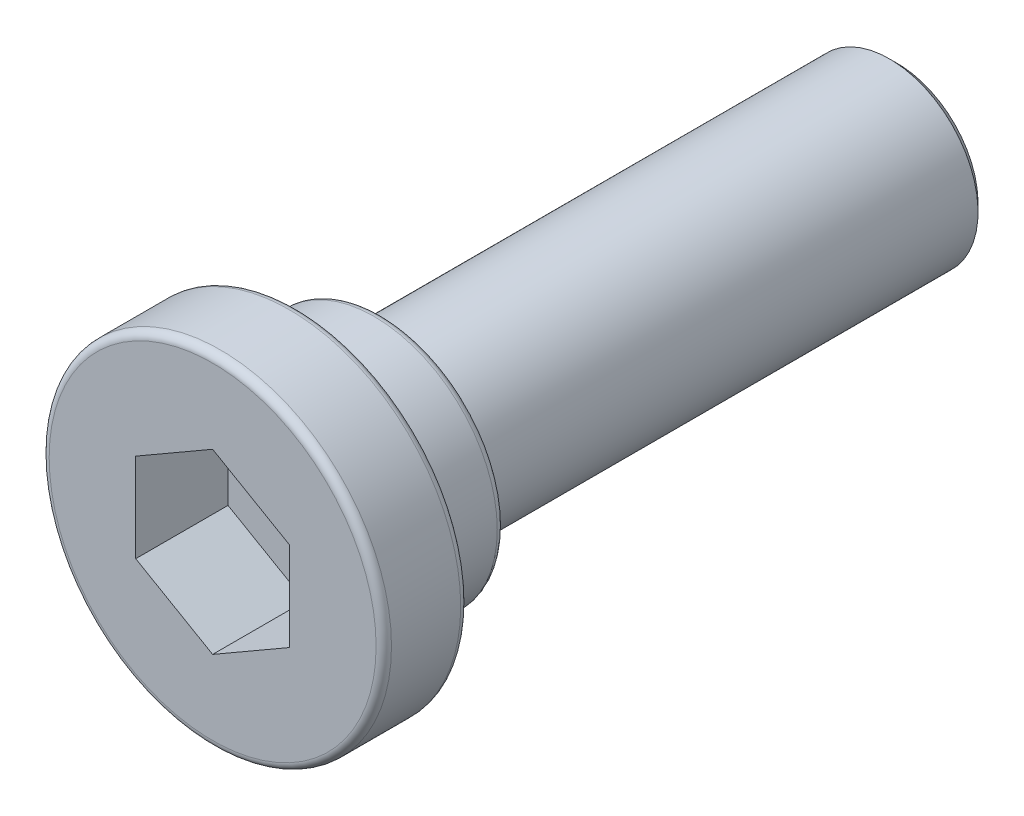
ISO-10303-21;
HEADER;
FILE_DESCRIPTION(('STEP AP214'),'2;1');
FILE_NAME('part.step','',(''),(''),'','','');
FILE_SCHEMA(('AUTOMOTIVE_DESIGN { 1 0 10303 214 1 1 1 1 }'));
ENDSEC;
DATA;
#1=APPLICATION_CONTEXT('core data for automotive mechanical design processes');
#2=APPLICATION_PROTOCOL_DEFINITION('international standard','automotive_design',2000,#1);
#3=PRODUCT_CONTEXT('',#1,'mechanical');
#4=PRODUCT('Part','Part','',(#3));
#5=PRODUCT_RELATED_PRODUCT_CATEGORY('part','',(#4));
#6=PRODUCT_DEFINITION_FORMATION('','',#4);
#7=PRODUCT_DEFINITION_CONTEXT('part definition',#1,'design');
#8=PRODUCT_DEFINITION('design','',#6,#7);
#9=PRODUCT_DEFINITION_SHAPE('','',#8);
#10=(LENGTH_UNIT() NAMED_UNIT(*) SI_UNIT(.MILLI.,.METRE.));
#11=(NAMED_UNIT(*) PLANE_ANGLE_UNIT() SI_UNIT($,.RADIAN.));
#12=(NAMED_UNIT(*) SI_UNIT($,.STERADIAN.) SOLID_ANGLE_UNIT());
#13=UNCERTAINTY_MEASURE_WITH_UNIT(LENGTH_MEASURE(1.E-05),#10,'distance_accuracy_value','');
#14=(GEOMETRIC_REPRESENTATION_CONTEXT(3) GLOBAL_UNCERTAINTY_ASSIGNED_CONTEXT((#13)) GLOBAL_UNIT_ASSIGNED_CONTEXT((#10,
#11,#12)) REPRESENTATION_CONTEXT('',''));
#15=CARTESIAN_POINT('',(0.,0.,0.));
#16=DIRECTION('',(0.,0.,1.));
#17=DIRECTION('',(1.,0.,0.));
#18=AXIS2_PLACEMENT_3D('',#15,#16,#17);
#19=CARTESIAN_POINT('',(0.,0.,7.7));
#20=DIRECTION('',(0.,0.,1.));
#21=DIRECTION('',(1.,0.,0.));
#22=AXIS2_PLACEMENT_3D('',#19,#20,#21);
#23=PLANE('',#22);
#24=DIRECTION('',(0.866025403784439,0.5,0.));
#25=VECTOR('',#24,1.);
#26=CARTESIAN_POINT('',(0.,-1.15470053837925,7.7));
#27=LINE('',#26,#25);
#28=CARTESIAN_POINT('',(0.,-1.15470053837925,7.7));
#29=VERTEX_POINT('',#28);
#30=CARTESIAN_POINT('',(1.,-0.577350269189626,7.7));
#31=VERTEX_POINT('',#30);
#32=EDGE_CURVE('E87',#29,#31,#27,.T.);
#33=ORIENTED_EDGE('',*,*,#32,.T.);
#34=DIRECTION('',(0.,1.,0.));
#35=VECTOR('',#34,1.);
#36=CARTESIAN_POINT('',(1.,-0.577350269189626,7.7));
#37=LINE('',#36,#35);
#38=CARTESIAN_POINT('',(1.,0.577350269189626,7.7));
#39=VERTEX_POINT('',#38);
#40=EDGE_CURVE('E89',#31,#39,#37,.T.);
#41=ORIENTED_EDGE('',*,*,#40,.T.);
#42=DIRECTION('',(-0.866025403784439,0.5,0.));
#43=VECTOR('',#42,1.);
#44=CARTESIAN_POINT('',(1.,0.577350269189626,7.7));
#45=LINE('',#44,#43);
#46=CARTESIAN_POINT('',(0.,1.15470053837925,7.7));
#47=VERTEX_POINT('',#46);
#48=EDGE_CURVE('E91',#39,#47,#45,.T.);
#49=ORIENTED_EDGE('',*,*,#48,.T.);
#50=DIRECTION('',(-0.866025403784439,-0.5,0.));
#51=VECTOR('',#50,1.);
#52=CARTESIAN_POINT('',(0.,1.15470053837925,7.7));
#53=LINE('',#52,#51);
#54=CARTESIAN_POINT('',(-1.,0.577350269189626,7.7));
#55=VERTEX_POINT('',#54);
#56=EDGE_CURVE('E241',#47,#55,#53,.T.);
#57=ORIENTED_EDGE('',*,*,#56,.T.);
#58=DIRECTION('',(0.,-1.,0.));
#59=VECTOR('',#58,1.);
#60=CARTESIAN_POINT('',(-1.,0.577350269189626,7.7));
#61=LINE('',#60,#59);
#62=CARTESIAN_POINT('',(-1.,-0.577350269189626,7.7));
#63=VERTEX_POINT('',#62);
#64=EDGE_CURVE('E246',#55,#63,#61,.T.);
#65=ORIENTED_EDGE('',*,*,#64,.T.);
#66=DIRECTION('',(0.866025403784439,-0.5,0.));
#67=VECTOR('',#66,1.);
#68=CARTESIAN_POINT('',(-1.,-0.577350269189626,7.7));
#69=LINE('',#68,#67);
#70=EDGE_CURVE('E250',#63,#29,#69,.T.);
#71=ORIENTED_EDGE('',*,*,#70,.T.);
#72=EDGE_LOOP('',(#33,#41,#49,#57,#65,#71));
#73=FACE_BOUND('',#72,.T.);
#74=ADVANCED_FACE('F17',(#73),#23,.T.);
#75=CARTESIAN_POINT('',(1.,0.577350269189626,7.7));
#76=DIRECTION('',(0.5,0.866025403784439,0.));
#77=DIRECTION('',(-0.866025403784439,0.5,0.));
#78=AXIS2_PLACEMENT_3D('',#75,#76,#77);
#79=PLANE('',#78);
#80=DIRECTION('',(0.,0.,1.));
#81=VECTOR('',#80,1.);
#82=CARTESIAN_POINT('',(0.,1.15470053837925,7.7));
#83=LINE('',#82,#81);
#84=CARTESIAN_POINT('',(0.,1.15470053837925,8.9));
#85=VERTEX_POINT('',#84);
#86=EDGE_CURVE('E102',#85,#47,#83,.F.);
#87=ORIENTED_EDGE('',*,*,#86,.T.);
#88=ORIENTED_EDGE('',*,*,#48,.F.);
#89=DIRECTION('',(0.,0.,1.));
#90=VECTOR('',#89,1.);
#91=CARTESIAN_POINT('',(1.,0.577350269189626,7.7));
#92=LINE('',#91,#90);
#93=CARTESIAN_POINT('',(1.,0.577350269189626,8.9));
#94=VERTEX_POINT('',#93);
#95=EDGE_CURVE('E96',#39,#94,#92,.T.);
#96=ORIENTED_EDGE('',*,*,#95,.T.);
#97=DIRECTION('',(0.866025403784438,-0.5,0.));
#98=VECTOR('',#97,1.);
#99=CARTESIAN_POINT('',(0.,1.15470053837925,8.9));
#100=LINE('',#99,#98);
#101=EDGE_CURVE('E240',#85,#94,#100,.T.);
#102=ORIENTED_EDGE('',*,*,#101,.F.);
#103=EDGE_LOOP('',(#87,#88,#96,#102));
#104=FACE_BOUND('',#103,.T.);
#105=ADVANCED_FACE('F99',(#104),#79,.F.);
#106=CARTESIAN_POINT('',(1.,-0.577350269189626,7.7));
#107=DIRECTION('',(1.,0.,0.));
#108=DIRECTION('',(0.,1.,0.));
#109=AXIS2_PLACEMENT_3D('',#106,#107,#108);
#110=PLANE('',#109);
#111=ORIENTED_EDGE('',*,*,#95,.F.);
#112=ORIENTED_EDGE('',*,*,#40,.F.);
#113=DIRECTION('',(0.,0.,1.));
#114=VECTOR('',#113,1.);
#115=CARTESIAN_POINT('',(1.,-0.577350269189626,7.7));
#116=LINE('',#115,#114);
#117=CARTESIAN_POINT('',(1.,-0.577350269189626,8.9));
#118=VERTEX_POINT('',#117);
#119=EDGE_CURVE('E110',#31,#118,#116,.T.);
#120=ORIENTED_EDGE('',*,*,#119,.T.);
#121=DIRECTION('',(0.,1.,0.));
#122=VECTOR('',#121,1.);
#123=CARTESIAN_POINT('',(1.,0.,8.9));
#124=LINE('',#123,#122);
#125=EDGE_CURVE('E107',#94,#118,#124,.F.);
#126=ORIENTED_EDGE('',*,*,#125,.F.);
#127=EDGE_LOOP('',(#111,#112,#120,#126));
#128=FACE_BOUND('',#127,.T.);
#129=ADVANCED_FACE('F105',(#128),#110,.F.);
#130=CARTESIAN_POINT('',(0.,-1.15470053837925,7.7));
#131=DIRECTION('',(0.5,-0.866025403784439,0.));
#132=DIRECTION('',(0.866025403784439,0.5,0.));
#133=AXIS2_PLACEMENT_3D('',#130,#131,#132);
#134=PLANE('',#133);
#135=ORIENTED_EDGE('',*,*,#119,.F.);
#136=ORIENTED_EDGE('',*,*,#32,.F.);
#137=DIRECTION('',(0.,0.,1.));
#138=VECTOR('',#137,1.);
#139=CARTESIAN_POINT('',(0.,-1.15470053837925,7.7));
#140=LINE('',#139,#138);
#141=CARTESIAN_POINT('',(0.,-1.15470053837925,8.9));
#142=VERTEX_POINT('',#141);
#143=EDGE_CURVE('E248',#29,#142,#140,.T.);
#144=ORIENTED_EDGE('',*,*,#143,.T.);
#145=DIRECTION('',(-0.866025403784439,-0.5,0.));
#146=VECTOR('',#145,1.);
#147=CARTESIAN_POINT('',(1.,-0.577350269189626,8.9));
#148=LINE('',#147,#146);
#149=EDGE_CURVE('E254',#118,#142,#148,.T.);
#150=ORIENTED_EDGE('',*,*,#149,.F.);
#151=EDGE_LOOP('',(#135,#136,#144,#150));
#152=FACE_BOUND('',#151,.T.);
#153=ADVANCED_FACE('F255',(#152),#134,.F.);
#154=CARTESIAN_POINT('',(-1.,-0.577350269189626,7.7));
#155=DIRECTION('',(-0.5,-0.866025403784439,0.));
#156=DIRECTION('',(0.866025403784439,-0.5,0.));
#157=AXIS2_PLACEMENT_3D('',#154,#155,#156);
#158=PLANE('',#157);
#159=ORIENTED_EDGE('',*,*,#143,.F.);
#160=ORIENTED_EDGE('',*,*,#70,.F.);
#161=DIRECTION('',(0.,0.,1.));
#162=VECTOR('',#161,1.);
#163=CARTESIAN_POINT('',(-1.,-0.577350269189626,7.7));
#164=LINE('',#163,#162);
#165=CARTESIAN_POINT('',(-1.,-0.577350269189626,8.9));
#166=VERTEX_POINT('',#165);
#167=EDGE_CURVE('E244',#63,#166,#164,.T.);
#168=ORIENTED_EDGE('',*,*,#167,.T.);
#169=DIRECTION('',(-0.866025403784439,0.5,0.));
#170=VECTOR('',#169,1.);
#171=CARTESIAN_POINT('',(0.,-1.15470053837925,8.9));
#172=LINE('',#171,#170);
#173=EDGE_CURVE('E260',#142,#166,#172,.T.);
#174=ORIENTED_EDGE('',*,*,#173,.F.);
#175=EDGE_LOOP('',(#159,#160,#168,#174));
#176=FACE_BOUND('',#175,.T.);
#177=ADVANCED_FACE('F393',(#176),#158,.F.);
#178=CARTESIAN_POINT('',(-1.,0.577350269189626,7.7));
#179=DIRECTION('',(-1.,0.,0.));
#180=DIRECTION('',(0.,-1.,0.));
#181=AXIS2_PLACEMENT_3D('',#178,#179,#180);
#182=PLANE('',#181);
#183=ORIENTED_EDGE('',*,*,#167,.F.);
#184=ORIENTED_EDGE('',*,*,#64,.F.);
#185=DIRECTION('',(0.,0.,1.));
#186=VECTOR('',#185,1.);
#187=CARTESIAN_POINT('',(-1.,0.577350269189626,7.7));
#188=LINE('',#187,#186);
#189=CARTESIAN_POINT('',(-1.,0.577350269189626,8.9));
#190=VERTEX_POINT('',#189);
#191=EDGE_CURVE('E233',#55,#190,#188,.T.);
#192=ORIENTED_EDGE('',*,*,#191,.T.);
#193=DIRECTION('',(0.,1.,0.));
#194=VECTOR('',#193,1.);
#195=CARTESIAN_POINT('',(-1.,0.,8.9));
#196=LINE('',#195,#194);
#197=EDGE_CURVE('E268',#166,#190,#196,.T.);
#198=ORIENTED_EDGE('',*,*,#197,.F.);
#199=EDGE_LOOP('',(#183,#184,#192,#198));
#200=FACE_BOUND('',#199,.T.);
#201=ADVANCED_FACE('F303',(#200),#182,.F.);
#202=CARTESIAN_POINT('',(0.,1.15470053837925,7.7));
#203=DIRECTION('',(-0.5,0.866025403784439,0.));
#204=DIRECTION('',(-0.866025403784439,-0.5,0.));
#205=AXIS2_PLACEMENT_3D('',#202,#203,#204);
#206=PLANE('',#205);
#207=ORIENTED_EDGE('',*,*,#191,.F.);
#208=ORIENTED_EDGE('',*,*,#56,.F.);
#209=ORIENTED_EDGE('',*,*,#86,.F.);
#210=DIRECTION('',(0.866025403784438,0.5,0.));
#211=VECTOR('',#210,1.);
#212=CARTESIAN_POINT('',(-1.,0.577350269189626,8.9));
#213=LINE('',#212,#211);
#214=EDGE_CURVE('E270',#190,#85,#213,.T.);
#215=ORIENTED_EDGE('',*,*,#214,.F.);
#216=EDGE_LOOP('',(#207,#208,#209,#215));
#217=FACE_BOUND('',#216,.T.);
#218=ADVANCED_FACE('F298',(#217),#206,.F.);
#219=CARTESIAN_POINT('',(0.,0.,8.9));
#220=DIRECTION('',(0.,0.,1.));
#221=DIRECTION('',(1.,0.,0.));
#222=AXIS2_PLACEMENT_3D('',#219,#220,#221);
#223=PLANE('',#222);
#224=ORIENTED_EDGE('',*,*,#197,.T.);
#225=ORIENTED_EDGE('',*,*,#214,.T.);
#226=ORIENTED_EDGE('',*,*,#101,.T.);
#227=ORIENTED_EDGE('',*,*,#125,.T.);
#228=ORIENTED_EDGE('',*,*,#149,.T.);
#229=ORIENTED_EDGE('',*,*,#173,.T.);
#230=EDGE_LOOP('',(#224,#225,#226,#227,#228,#229));
#231=FACE_BOUND('',#230,.T.);
#232=CARTESIAN_POINT('',(0.,0.,8.9));
#233=DIRECTION('',(0.,0.,-1.));
#234=DIRECTION('',(-1.,0.,0.));
#235=AXIS2_PLACEMENT_3D('',#232,#233,#234);
#236=CIRCLE('',#235,2.125);
#237=CARTESIAN_POINT('',(-2.125,0.,8.9));
#238=VERTEX_POINT('',#237);
#239=CARTESIAN_POINT('',(2.125,0.,8.9));
#240=VERTEX_POINT('',#239);
#241=EDGE_CURVE('E272',#238,#240,#236,.T.);
#242=ORIENTED_EDGE('',*,*,#241,.F.);
#243=CARTESIAN_POINT('',(0.,0.,8.9));
#244=DIRECTION('',(0.,0.,-1.));
#245=DIRECTION('',(1.,0.,0.));
#246=AXIS2_PLACEMENT_3D('',#243,#244,#245);
#247=CIRCLE('',#246,2.125);
#248=EDGE_CURVE('E212',#240,#238,#247,.T.);
#249=ORIENTED_EDGE('',*,*,#248,.F.);
#250=EDGE_LOOP('',(#242,#249));
#251=FACE_BOUND('',#250,.T.);
#252=ADVANCED_FACE('F221',(#231,#251),#223,.T.);
#253=CARTESIAN_POINT('',(0.,0.,8.8));
#254=DIRECTION('',(0.,0.,1.));
#255=DIRECTION('',(1.,0.,0.));
#256=AXIS2_PLACEMENT_3D('',#253,#254,#255);
#257=TOROIDAL_SURFACE('',#256,2.125,0.1);
#258=CARTESIAN_POINT('',(0.,0.,8.8));
#259=DIRECTION('',(0.,0.,-1.));
#260=DIRECTION('',(-1.,0.,0.));
#261=AXIS2_PLACEMENT_3D('',#258,#259,#260);
#262=CIRCLE('',#261,2.225);
#263=CARTESIAN_POINT('',(-2.225,0.,8.8));
#264=VERTEX_POINT('',#263);
#265=EDGE_CURVE('E209',#264,#264,#262,.T.);
#266=ORIENTED_EDGE('',*,*,#265,.F.);
#267=EDGE_LOOP('',(#266));
#268=FACE_BOUND('',#267,.T.);
#269=ORIENTED_EDGE('',*,*,#248,.T.);
#270=ORIENTED_EDGE('',*,*,#241,.T.);
#271=EDGE_LOOP('',(#269,#270));
#272=FACE_BOUND('',#271,.T.);
#273=ADVANCED_FACE('F216',(#268,#272),#257,.T.);
#274=CARTESIAN_POINT('',(0.,0.,8.9));
#275=DIRECTION('',(0.,0.,-1.));
#276=DIRECTION('',(-1.,0.,0.));
#277=AXIS2_PLACEMENT_3D('',#274,#275,#276);
#278=CYLINDRICAL_SURFACE('',#277,2.225);
#279=ORIENTED_EDGE('',*,*,#265,.T.);
#280=EDGE_LOOP('',(#279));
#281=FACE_BOUND('',#280,.T.);
#282=CARTESIAN_POINT('',(0.,0.,7.9));
#283=DIRECTION('',(0.,0.,1.));
#284=DIRECTION('',(1.,0.,0.));
#285=AXIS2_PLACEMENT_3D('',#282,#283,#284);
#286=CIRCLE('',#285,2.225);
#287=CARTESIAN_POINT('',(2.225,0.,7.9));
#288=VERTEX_POINT('',#287);
#289=EDGE_CURVE('E201',#288,#288,#286,.F.);
#290=ORIENTED_EDGE('',*,*,#289,.F.);
#291=EDGE_LOOP('',(#290));
#292=FACE_BOUND('',#291,.T.);
#293=ADVANCED_FACE('F220',(#281,#292),#278,.T.);
#294=CARTESIAN_POINT('',(0.,0.,7.9));
#295=DIRECTION('',(0.,0.,1.));
#296=DIRECTION('',(1.,0.,0.));
#297=AXIS2_PLACEMENT_3D('',#294,#295,#296);
#298=TOROIDAL_SURFACE('',#297,2.125,0.1);
#299=CARTESIAN_POINT('',(0.,0.,7.8));
#300=DIRECTION('',(0.,0.,1.));
#301=DIRECTION('',(1.,0.,0.));
#302=AXIS2_PLACEMENT_3D('',#299,#300,#301);
#303=CIRCLE('',#302,2.125);
#304=CARTESIAN_POINT('',(2.125,0.,7.8));
#305=VERTEX_POINT('',#304);
#306=CARTESIAN_POINT('',(-2.125,0.,7.8));
#307=VERTEX_POINT('',#306);
#308=EDGE_CURVE('E167',#305,#307,#303,.T.);
#309=ORIENTED_EDGE('',*,*,#308,.T.);
#310=CARTESIAN_POINT('',(0.,0.,7.8));
#311=DIRECTION('',(0.,0.,1.));
#312=DIRECTION('',(-1.,0.,0.));
#313=AXIS2_PLACEMENT_3D('',#310,#311,#312);
#314=CIRCLE('',#313,2.125);
#315=EDGE_CURVE('E123',#307,#305,#314,.T.);
#316=ORIENTED_EDGE('',*,*,#315,.T.);
#317=EDGE_LOOP('',(#309,#316));
#318=FACE_BOUND('',#317,.T.);
#319=ORIENTED_EDGE('',*,*,#289,.T.);
#320=EDGE_LOOP('',(#319));
#321=FACE_BOUND('',#320,.T.);
#322=ADVANCED_FACE('F181',(#318,#321),#298,.T.);
#323=CARTESIAN_POINT('',(0.,0.,7.8));
#324=DIRECTION('',(0.,0.,1.));
#325=DIRECTION('',(1.,0.,0.));
#326=AXIS2_PLACEMENT_3D('',#323,#324,#325);
#327=PLANE('',#326);
#328=CARTESIAN_POINT('',(0.,0.,7.8));
#329=DIRECTION('',(0.,0.,-1.));
#330=DIRECTION('',(-1.,0.,0.));
#331=AXIS2_PLACEMENT_3D('',#328,#329,#330);
#332=CIRCLE('',#331,1.6);
#333=CARTESIAN_POINT('',(-1.6,0.,7.8));
#334=VERTEX_POINT('',#333);
#335=EDGE_CURVE('E120',#334,#334,#332,.T.);
#336=ORIENTED_EDGE('',*,*,#335,.F.);
#337=EDGE_LOOP('',(#336));
#338=FACE_BOUND('',#337,.T.);
#339=ORIENTED_EDGE('',*,*,#308,.F.);
#340=ORIENTED_EDGE('',*,*,#315,.F.);
#341=EDGE_LOOP('',(#339,#340));
#342=FACE_BOUND('',#341,.T.);
#343=ADVANCED_FACE('F172',(#338,#342),#327,.F.);
#344=CARTESIAN_POINT('',(0.,0.,7.8));
#345=DIRECTION('',(0.,0.,-1.));
#346=DIRECTION('',(-1.,0.,0.));
#347=AXIS2_PLACEMENT_3D('',#344,#345,#346);
#348=CYLINDRICAL_SURFACE('',#347,1.6);
#349=ORIENTED_EDGE('',*,*,#335,.T.);
#350=EDGE_LOOP('',(#349));
#351=FACE_BOUND('',#350,.T.);
#352=CARTESIAN_POINT('',(0.,0.,6.8));
#353=DIRECTION('',(0.,0.,1.));
#354=DIRECTION('',(1.,0.,0.));
#355=AXIS2_PLACEMENT_3D('',#352,#353,#354);
#356=CIRCLE('',#355,1.6);
#357=CARTESIAN_POINT('',(1.6,0.,6.8));
#358=VERTEX_POINT('',#357);
#359=EDGE_CURVE('E122',#358,#358,#356,.F.);
#360=ORIENTED_EDGE('',*,*,#359,.F.);
#361=EDGE_LOOP('',(#360));
#362=FACE_BOUND('',#361,.T.);
#363=ADVANCED_FACE('F142',(#351,#362),#348,.T.);
#364=CARTESIAN_POINT('',(0.,0.,6.8));
#365=DIRECTION('',(0.,0.,1.));
#366=DIRECTION('',(1.,0.,0.));
#367=AXIS2_PLACEMENT_3D('',#364,#365,#366);
#368=TOROIDAL_SURFACE('',#367,1.5,0.1);
#369=CARTESIAN_POINT('',(0.,0.,6.7));
#370=DIRECTION('',(0.,0.,1.));
#371=DIRECTION('',(1.,0.,0.));
#372=AXIS2_PLACEMENT_3D('',#369,#370,#371);
#373=CIRCLE('',#372,1.5);
#374=CARTESIAN_POINT('',(1.5,0.,6.7));
#375=VERTEX_POINT('',#374);
#376=CARTESIAN_POINT('',(-1.5,0.,6.7));
#377=VERTEX_POINT('',#376);
#378=EDGE_CURVE('E36',#375,#377,#373,.T.);
#379=ORIENTED_EDGE('',*,*,#378,.T.);
#380=CARTESIAN_POINT('',(0.,0.,6.7));
#381=DIRECTION('',(0.,0.,1.));
#382=DIRECTION('',(-1.,0.,0.));
#383=AXIS2_PLACEMENT_3D('',#380,#381,#382);
#384=CIRCLE('',#383,1.5);
#385=EDGE_CURVE('E119',#377,#375,#384,.T.);
#386=ORIENTED_EDGE('',*,*,#385,.T.);
#387=EDGE_LOOP('',(#379,#386));
#388=FACE_BOUND('',#387,.T.);
#389=ORIENTED_EDGE('',*,*,#359,.T.);
#390=EDGE_LOOP('',(#389));
#391=FACE_BOUND('',#390,.T.);
#392=ADVANCED_FACE('F130',(#388,#391),#368,.T.);
#393=CARTESIAN_POINT('',(0.,0.,0.));
#394=DIRECTION('',(0.,0.,1.));
#395=DIRECTION('',(1.,0.,0.));
#396=AXIS2_PLACEMENT_3D('',#393,#394,#395);
#397=PLANE('',#396);
#398=CARTESIAN_POINT('',(0.,0.,0.));
#399=DIRECTION('',(0.,0.,1.));
#400=DIRECTION('',(0.,-1.,0.));
#401=AXIS2_PLACEMENT_3D('',#398,#399,#400);
#402=CIRCLE('',#401,1.05000000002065);
#403=CARTESIAN_POINT('',(0.,-1.05000000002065,0.));
#404=VERTEX_POINT('',#403);
#405=EDGE_CURVE('E116',#404,#404,#402,.T.);
#406=ORIENTED_EDGE('',*,*,#405,.F.);
#407=EDGE_LOOP('',(#406));
#408=FACE_BOUND('',#407,.T.);
#409=ADVANCED_FACE('F141',(#408),#397,.F.);
#410=CARTESIAN_POINT('',(0.,0.,6.7));
#411=DIRECTION('',(0.,0.,1.));
#412=DIRECTION('',(1.,0.,0.));
#413=AXIS2_PLACEMENT_3D('',#410,#411,#412);
#414=PLANE('',#413);
#415=CARTESIAN_POINT('',(0.,0.,6.7));
#416=DIRECTION('',(0.,0.,-1.));
#417=DIRECTION('',(-1.,0.,0.));
#418=AXIS2_PLACEMENT_3D('',#415,#416,#417);
#419=CIRCLE('',#418,1.15);
#420=CARTESIAN_POINT('',(-1.15,0.,6.7));
#421=VERTEX_POINT('',#420);
#422=EDGE_CURVE('E28',#421,#421,#419,.T.);
#423=ORIENTED_EDGE('',*,*,#422,.F.);
#424=EDGE_LOOP('',(#423));
#425=FACE_BOUND('',#424,.T.);
#426=ORIENTED_EDGE('',*,*,#378,.F.);
#427=ORIENTED_EDGE('',*,*,#385,.F.);
#428=EDGE_LOOP('',(#426,#427));
#429=FACE_BOUND('',#428,.T.);
#430=ADVANCED_FACE('F313',(#425,#429),#414,.F.);
#431=CARTESIAN_POINT('',(0.,0.,0.0999999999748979));
#432=DIRECTION('',(0.,0.,1.));
#433=DIRECTION('',(0.,-1.,0.));
#434=AXIS2_PLACEMENT_3D('',#431,#432,#433);
#435=CONICAL_SURFACE('',#434,1.14999999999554,0.785398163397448);
#436=CARTESIAN_POINT('',(0.,0.,0.100000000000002));
#437=DIRECTION('',(0.,0.,-1.));
#438=DIRECTION('',(-1.,0.,0.));
#439=AXIS2_PLACEMENT_3D('',#436,#437,#438);
#440=CIRCLE('',#439,1.15);
#441=CARTESIAN_POINT('',(-1.15,0.,0.100000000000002));
#442=VERTEX_POINT('',#441);
#443=EDGE_CURVE('E11',#442,#442,#440,.F.);
#444=ORIENTED_EDGE('',*,*,#443,.F.);
#445=EDGE_LOOP('',(#444));
#446=FACE_BOUND('',#445,.T.);
#447=ORIENTED_EDGE('',*,*,#405,.T.);
#448=EDGE_LOOP('',(#447));
#449=FACE_BOUND('',#448,.T.);
#450=ADVANCED_FACE('F307',(#446,#449),#435,.T.);
#451=CARTESIAN_POINT('',(0.,0.,6.7));
#452=DIRECTION('',(0.,0.,-1.));
#453=DIRECTION('',(-1.,0.,0.));
#454=AXIS2_PLACEMENT_3D('',#451,#452,#453);
#455=CYLINDRICAL_SURFACE('',#454,1.15);
#456=ORIENTED_EDGE('',*,*,#443,.T.);
#457=EDGE_LOOP('',(#456));
#458=FACE_BOUND('',#457,.T.);
#459=ORIENTED_EDGE('',*,*,#422,.T.);
#460=EDGE_LOOP('',(#459));
#461=FACE_BOUND('',#460,.T.);
#462=ADVANCED_FACE('F305',(#458,#461),#455,.T.);
#463=CLOSED_SHELL('',(#74,#105,#129,#153,#177,#201,#218,#252,#273,#293,#322,#343,#363,#392,#409,
#430,#450,#462));
#464=MANIFOLD_SOLID_BREP('B1',#463);
#465=ADVANCED_BREP_SHAPE_REPRESENTATION('',(#18,#464),#14);
#466=SHAPE_DEFINITION_REPRESENTATION(#9,#465);
ENDSEC;
END-ISO-10303-21;
